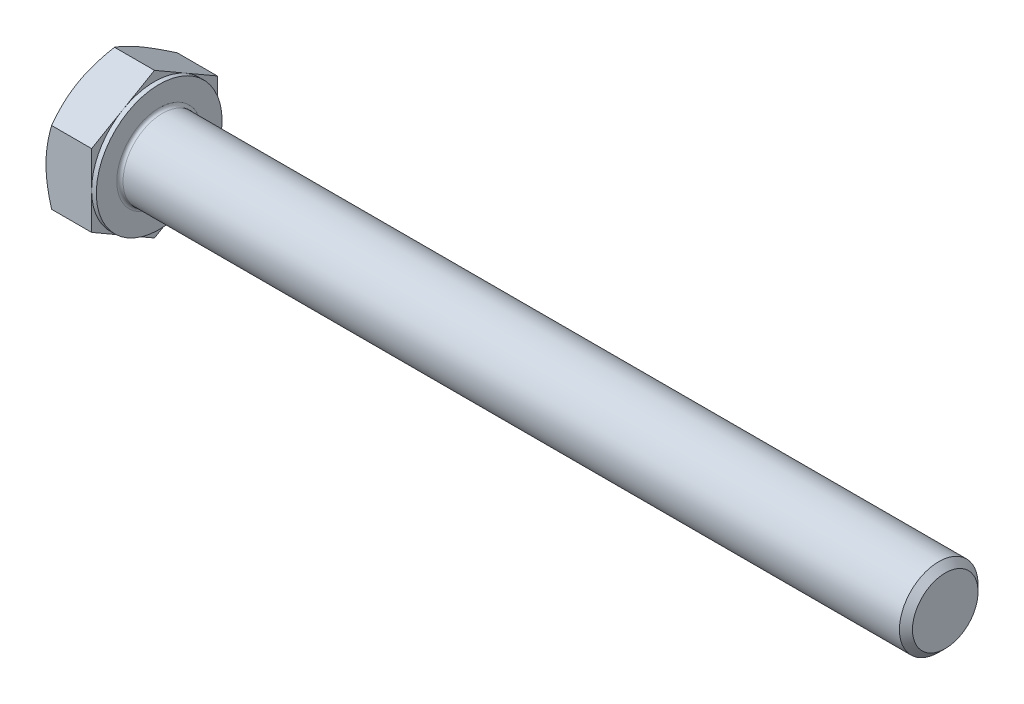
ISO-10303-21;
HEADER;
FILE_DESCRIPTION(('STEP AP214'),'2;1');
FILE_NAME('part.step','',(''),(''),'','','');
FILE_SCHEMA(('AUTOMOTIVE_DESIGN { 1 0 10303 214 1 1 1 1 }'));
ENDSEC;
DATA;
#1=APPLICATION_CONTEXT('core data for automotive mechanical design processes');
#2=APPLICATION_PROTOCOL_DEFINITION('international standard','automotive_design',2000,#1);
#3=PRODUCT_CONTEXT('',#1,'mechanical');
#4=PRODUCT('Part','Part','',(#3));
#5=PRODUCT_RELATED_PRODUCT_CATEGORY('part','',(#4));
#6=PRODUCT_DEFINITION_FORMATION('','',#4);
#7=PRODUCT_DEFINITION_CONTEXT('part definition',#1,'design');
#8=PRODUCT_DEFINITION('design','',#6,#7);
#9=PRODUCT_DEFINITION_SHAPE('','',#8);
#10=(LENGTH_UNIT() NAMED_UNIT(*) SI_UNIT(.MILLI.,.METRE.));
#11=(NAMED_UNIT(*) PLANE_ANGLE_UNIT() SI_UNIT($,.RADIAN.));
#12=(NAMED_UNIT(*) SI_UNIT($,.STERADIAN.) SOLID_ANGLE_UNIT());
#13=UNCERTAINTY_MEASURE_WITH_UNIT(LENGTH_MEASURE(1.E-05),#10,'distance_accuracy_value','');
#14=(GEOMETRIC_REPRESENTATION_CONTEXT(3) GLOBAL_UNCERTAINTY_ASSIGNED_CONTEXT((#13)) GLOBAL_UNIT_ASSIGNED_CONTEXT((#10,
#11,#12)) REPRESENTATION_CONTEXT('',''));
#15=CARTESIAN_POINT('',(0.,0.,0.));
#16=DIRECTION('',(0.,0.,1.));
#17=DIRECTION('',(1.,0.,0.));
#18=AXIS2_PLACEMENT_3D('',#15,#16,#17);
#19=CARTESIAN_POINT('',(6.4,9.23760430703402,0.));
#20=DIRECTION('',(1.,0.,0.));
#21=DIRECTION('',(0.,0.,-1.));
#22=AXIS2_PLACEMENT_3D('',#19,#20,#21);
#23=PLANE('',#22);
#24=CARTESIAN_POINT('',(6.4,0.,0.));
#25=DIRECTION('',(1.,0.,0.));
#26=DIRECTION('',(0.,0.,-1.));
#27=AXIS2_PLACEMENT_3D('',#24,#25,#26);
#28=CIRCLE('',#27,5.4);
#29=CARTESIAN_POINT('',(6.4,0.,-5.4));
#30=VERTEX_POINT('',#29);
#31=EDGE_CURVE('E39',#30,#30,#28,.F.);
#32=ORIENTED_EDGE('',*,*,#31,.T.);
#33=EDGE_LOOP('',(#32));
#34=FACE_BOUND('',#33,.T.);
#35=CARTESIAN_POINT('',(6.4,0.,0.));
#36=DIRECTION('',(1.,0.,0.));
#37=DIRECTION('',(0.,0.,-1.));
#38=AXIS2_PLACEMENT_3D('',#35,#36,#37);
#39=CIRCLE('',#38,8.);
#40=CARTESIAN_POINT('',(6.4,0.,-8.));
#41=VERTEX_POINT('',#40);
#42=EDGE_CURVE('E290',#41,#41,#39,.T.);
#43=ORIENTED_EDGE('',*,*,#42,.T.);
#44=EDGE_LOOP('',(#43));
#45=FACE_BOUND('',#44,.T.);
#46=ADVANCED_FACE('F31',(#34,#45),#23,.T.);
#47=CARTESIAN_POINT('',(0.,0.,0.));
#48=DIRECTION('',(-1.,0.,0.));
#49=DIRECTION('',(0.,0.,1.));
#50=AXIS2_PLACEMENT_3D('',#47,#48,#49);
#51=CYLINDRICAL_SURFACE('',#50,5.);
#52=CARTESIAN_POINT('',(6.8,0.,0.));
#53=DIRECTION('',(1.,0.,0.));
#54=DIRECTION('',(0.,0.,-1.));
#55=AXIS2_PLACEMENT_3D('',#52,#53,#54);
#56=CIRCLE('',#55,5.);
#57=CARTESIAN_POINT('',(6.8,0.,-5.));
#58=VERTEX_POINT('',#57);
#59=EDGE_CURVE('E11',#58,#58,#56,.T.);
#60=ORIENTED_EDGE('',*,*,#59,.T.);
#61=EDGE_LOOP('',(#60));
#62=FACE_BOUND('',#61,.T.);
#63=CARTESIAN_POINT('',(105.572,0.,0.));
#64=DIRECTION('',(-1.,0.,0.));
#65=DIRECTION('',(0.,0.,1.));
#66=AXIS2_PLACEMENT_3D('',#63,#64,#65);
#67=CIRCLE('',#66,5.);
#68=CARTESIAN_POINT('',(105.572,0.,5.));
#69=VERTEX_POINT('',#68);
#70=EDGE_CURVE('E269',#69,#69,#67,.T.);
#71=ORIENTED_EDGE('',*,*,#70,.T.);
#72=EDGE_LOOP('',(#71));
#73=FACE_BOUND('',#72,.T.);
#74=ADVANCED_FACE('F243',(#62,#73),#51,.T.);
#75=CARTESIAN_POINT('',(106.4,0.,0.));
#76=DIRECTION('',(-1.,0.,0.));
#77=DIRECTION('',(0.,0.,1.));
#78=AXIS2_PLACEMENT_3D('',#75,#76,#77);
#79=CONICAL_SURFACE('',#78,4.172,0.785398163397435);
#80=ORIENTED_EDGE('',*,*,#70,.F.);
#81=EDGE_LOOP('',(#80));
#82=FACE_BOUND('',#81,.T.);
#83=CARTESIAN_POINT('',(106.4,0.,0.));
#84=DIRECTION('',(-1.,0.,0.));
#85=DIRECTION('',(0.,0.,1.));
#86=AXIS2_PLACEMENT_3D('',#83,#84,#85);
#87=CIRCLE('',#86,4.172);
#88=CARTESIAN_POINT('',(106.4,0.,4.172));
#89=VERTEX_POINT('',#88);
#90=EDGE_CURVE('E267',#89,#89,#87,.T.);
#91=ORIENTED_EDGE('',*,*,#90,.T.);
#92=EDGE_LOOP('',(#91));
#93=FACE_BOUND('',#92,.T.);
#94=ADVANCED_FACE('F248',(#82,#93),#79,.T.);
#95=CARTESIAN_POINT('',(106.4,0.,0.));
#96=DIRECTION('',(-1.,0.,0.));
#97=DIRECTION('',(0.,0.,1.));
#98=AXIS2_PLACEMENT_3D('',#95,#96,#97);
#99=PLANE('',#98);
#100=ORIENTED_EDGE('',*,*,#90,.F.);
#101=EDGE_LOOP('',(#100));
#102=FACE_BOUND('',#101,.T.);
#103=ADVANCED_FACE('F255',(#102),#99,.F.);
#104=CARTESIAN_POINT('',(5.8,8.,0.));
#105=DIRECTION('',(1.,0.,0.));
#106=DIRECTION('',(0.,0.,-1.));
#107=AXIS2_PLACEMENT_3D('',#104,#105,#106);
#108=PLANE('',#107);
#109=DIRECTION('',(0.,0.500000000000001,0.866025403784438));
#110=VECTOR('',#109,1.);
#111=CARTESIAN_POINT('',(5.8,4.618802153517,-8.));
#112=LINE('',#111,#110);
#113=CARTESIAN_POINT('',(5.8,4.618802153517,-8.));
#114=VERTEX_POINT('',#113);
#115=CARTESIAN_POINT('',(5.8,6.9282032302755,-4.00000000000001));
#116=VERTEX_POINT('',#115);
#117=EDGE_CURVE('E163',#114,#116,#112,.T.);
#118=ORIENTED_EDGE('',*,*,#117,.T.);
#119=CARTESIAN_POINT('',(5.8,0.,0.));
#120=DIRECTION('',(-1.,0.,0.));
#121=DIRECTION('',(0.,0.,1.));
#122=AXIS2_PLACEMENT_3D('',#119,#120,#121);
#123=CIRCLE('',#122,8.);
#124=CARTESIAN_POINT('',(5.8,0.,-8.));
#125=VERTEX_POINT('',#124);
#126=EDGE_CURVE('E46',#116,#125,#123,.T.);
#127=ORIENTED_EDGE('',*,*,#126,.T.);
#128=DIRECTION('',(0.,1.,0.));
#129=VECTOR('',#128,1.);
#130=CARTESIAN_POINT('',(5.8,4.618802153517,-8.));
#131=LINE('',#130,#129);
#132=EDGE_CURVE('E293',#125,#114,#131,.T.);
#133=ORIENTED_EDGE('',*,*,#132,.T.);
#134=EDGE_LOOP('',(#118,#127,#133));
#135=FACE_BOUND('',#134,.T.);
#136=ADVANCED_FACE('F258',(#135),#108,.T.);
#137=CARTESIAN_POINT('',(5.8,9.23760430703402,0.));
#138=VERTEX_POINT('',#137);
#139=EDGE_CURVE('E161',#116,#138,#112,.T.);
#140=ORIENTED_EDGE('',*,*,#139,.T.);
#141=DIRECTION('',(0.,-0.500000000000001,0.866025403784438));
#142=VECTOR('',#141,1.);
#143=CARTESIAN_POINT('',(5.8,9.23760430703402,0.));
#144=LINE('',#143,#142);
#145=CARTESIAN_POINT('',(5.8,6.9282032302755,4.00000000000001));
#146=VERTEX_POINT('',#145);
#147=EDGE_CURVE('E160',#138,#146,#144,.T.);
#148=ORIENTED_EDGE('',*,*,#147,.T.);
#149=EDGE_CURVE('E149',#146,#116,#123,.T.);
#150=ORIENTED_EDGE('',*,*,#149,.T.);
#151=EDGE_LOOP('',(#140,#148,#150));
#152=FACE_BOUND('',#151,.T.);
#153=ADVANCED_FACE('F263',(#152),#108,.T.);
#154=CARTESIAN_POINT('',(5.8,4.618802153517,8.));
#155=VERTEX_POINT('',#154);
#156=EDGE_CURVE('E128',#146,#155,#144,.T.);
#157=ORIENTED_EDGE('',*,*,#156,.T.);
#158=DIRECTION('',(0.,-1.,0.));
#159=VECTOR('',#158,1.);
#160=CARTESIAN_POINT('',(5.8,4.618802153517,8.));
#161=LINE('',#160,#159);
#162=CARTESIAN_POINT('',(5.8,0.,8.));
#163=VERTEX_POINT('',#162);
#164=EDGE_CURVE('E122',#155,#163,#161,.T.);
#165=ORIENTED_EDGE('',*,*,#164,.T.);
#166=EDGE_CURVE('E126',#163,#146,#123,.T.);
#167=ORIENTED_EDGE('',*,*,#166,.T.);
#168=EDGE_LOOP('',(#157,#165,#167));
#169=FACE_BOUND('',#168,.T.);
#170=ADVANCED_FACE('F124',(#169),#108,.T.);
#171=CARTESIAN_POINT('',(5.8,-4.61880215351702,8.));
#172=VERTEX_POINT('',#171);
#173=EDGE_CURVE('E132',#163,#172,#161,.T.);
#174=ORIENTED_EDGE('',*,*,#173,.T.);
#175=DIRECTION('',(0.,-0.500000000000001,-0.866025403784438));
#176=VECTOR('',#175,1.);
#177=CARTESIAN_POINT('',(5.8,-9.23760430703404,0.));
#178=LINE('',#177,#176);
#179=CARTESIAN_POINT('',(5.8,-6.92820323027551,4.00000000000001));
#180=VERTEX_POINT('',#179);
#181=EDGE_CURVE('E139',#172,#180,#178,.T.);
#182=ORIENTED_EDGE('',*,*,#181,.T.);
#183=EDGE_CURVE('E136',#180,#163,#123,.T.);
#184=ORIENTED_EDGE('',*,*,#183,.T.);
#185=EDGE_LOOP('',(#174,#182,#184));
#186=FACE_BOUND('',#185,.T.);
#187=ADVANCED_FACE('F137',(#186),#108,.T.);
#188=CARTESIAN_POINT('',(5.8,-9.23760430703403,0.));
#189=VERTEX_POINT('',#188);
#190=EDGE_CURVE('E155',#180,#189,#178,.T.);
#191=ORIENTED_EDGE('',*,*,#190,.T.);
#192=DIRECTION('',(0.,0.500000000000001,-0.866025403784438));
#193=VECTOR('',#192,1.);
#194=CARTESIAN_POINT('',(5.8,-4.61880215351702,-8.));
#195=LINE('',#194,#193);
#196=CARTESIAN_POINT('',(5.8,-6.92820323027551,-4.00000000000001));
#197=VERTEX_POINT('',#196);
#198=EDGE_CURVE('E331',#189,#197,#195,.T.);
#199=ORIENTED_EDGE('',*,*,#198,.T.);
#200=EDGE_CURVE('E143',#197,#180,#123,.T.);
#201=ORIENTED_EDGE('',*,*,#200,.T.);
#202=EDGE_LOOP('',(#191,#199,#201));
#203=FACE_BOUND('',#202,.T.);
#204=ADVANCED_FACE('F332',(#203),#108,.T.);
#205=CARTESIAN_POINT('',(5.8,-4.61880215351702,-8.));
#206=VERTEX_POINT('',#205);
#207=EDGE_CURVE('E150',#197,#206,#195,.T.);
#208=ORIENTED_EDGE('',*,*,#207,.T.);
#209=EDGE_CURVE('E294',#206,#125,#131,.T.);
#210=ORIENTED_EDGE('',*,*,#209,.T.);
#211=EDGE_CURVE('E301',#125,#197,#123,.T.);
#212=ORIENTED_EDGE('',*,*,#211,.T.);
#213=EDGE_LOOP('',(#208,#210,#212));
#214=FACE_BOUND('',#213,.T.);
#215=ADVANCED_FACE('F264',(#214),#108,.T.);
#216=CARTESIAN_POINT('',(0.,0.,0.));
#217=DIRECTION('',(-1.,0.,0.));
#218=DIRECTION('',(0.,0.,1.));
#219=AXIS2_PLACEMENT_3D('',#216,#217,#218);
#220=CYLINDRICAL_SURFACE('',#219,8.);
#221=ORIENTED_EDGE('',*,*,#126,.F.);
#222=ORIENTED_EDGE('',*,*,#149,.F.);
#223=ORIENTED_EDGE('',*,*,#166,.F.);
#224=ORIENTED_EDGE('',*,*,#183,.F.);
#225=ORIENTED_EDGE('',*,*,#200,.F.);
#226=ORIENTED_EDGE('',*,*,#211,.F.);
#227=EDGE_LOOP('',(#221,#222,#223,#224,#225,#226));
#228=FACE_BOUND('',#227,.T.);
#229=ORIENTED_EDGE('',*,*,#42,.F.);
#230=EDGE_LOOP('',(#229));
#231=FACE_BOUND('',#230,.T.);
#232=ADVANCED_FACE('F146',(#228,#231),#220,.T.);
#233=CARTESIAN_POINT('',(0.,9.23760430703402,0.));
#234=DIRECTION('',(1.,0.,0.));
#235=DIRECTION('',(0.,0.,-1.));
#236=AXIS2_PLACEMENT_3D('',#233,#234,#235);
#237=PLANE('',#236);
#238=CARTESIAN_POINT('',(0.,0.,0.));
#239=DIRECTION('',(1.,0.,0.));
#240=DIRECTION('',(0.,0.,-1.));
#241=AXIS2_PLACEMENT_3D('',#238,#239,#240);
#242=CIRCLE('',#241,8.);
#243=CARTESIAN_POINT('',(0.,0.,-8.));
#244=VERTEX_POINT('',#243);
#245=CARTESIAN_POINT('',(0.,6.92820323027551,-4.00000000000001));
#246=VERTEX_POINT('',#245);
#247=EDGE_CURVE('E289',#244,#246,#242,.T.);
#248=ORIENTED_EDGE('',*,*,#247,.F.);
#249=CARTESIAN_POINT('',(0.,-6.92820323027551,-4.00000000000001));
#250=VERTEX_POINT('',#249);
#251=EDGE_CURVE('E285',#250,#244,#242,.T.);
#252=ORIENTED_EDGE('',*,*,#251,.F.);
#253=CARTESIAN_POINT('',(0.,-6.92820323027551,4.00000000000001));
#254=VERTEX_POINT('',#253);
#255=EDGE_CURVE('E288',#254,#250,#242,.T.);
#256=ORIENTED_EDGE('',*,*,#255,.F.);
#257=CARTESIAN_POINT('',(0.,0.,8.));
#258=VERTEX_POINT('',#257);
#259=EDGE_CURVE('E324',#258,#254,#242,.T.);
#260=ORIENTED_EDGE('',*,*,#259,.F.);
#261=CARTESIAN_POINT('',(0.,0.,0.));
#262=DIRECTION('',(-1.,0.,0.));
#263=DIRECTION('',(0.,0.,1.));
#264=AXIS2_PLACEMENT_3D('',#261,#262,#263);
#265=CIRCLE('',#264,8.);
#266=CARTESIAN_POINT('',(0.,6.92820323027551,4.00000000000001));
#267=VERTEX_POINT('',#266);
#268=EDGE_CURVE('E164',#258,#267,#265,.T.);
#269=ORIENTED_EDGE('',*,*,#268,.T.);
#270=EDGE_CURVE('E347',#246,#267,#242,.T.);
#271=ORIENTED_EDGE('',*,*,#270,.F.);
#272=EDGE_LOOP('',(#248,#252,#256,#260,#269,#271));
#273=FACE_BOUND('',#272,.T.);
#274=ADVANCED_FACE('F193',(#273),#237,.F.);
#275=CARTESIAN_POINT('',(0.,0.,0.));
#276=DIRECTION('',(1.,0.,0.));
#277=DIRECTION('',(0.,0.,-1.));
#278=AXIS2_PLACEMENT_3D('',#275,#276,#277);
#279=CONICAL_SURFACE('',#278,8.,1.0471975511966);
#280=CARTESIAN_POINT('',(0.714597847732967,4.61868668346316,8.0002));
#281=CARTESIAN_POINT('',(0.655990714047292,4.72021302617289,7.8243512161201));
#282=CARTESIAN_POINT('',(0.600043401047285,4.82211789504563,7.64784680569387));
#283=CARTESIAN_POINT('',(0.494201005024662,5.02675523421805,7.29340453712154));
#284=CARTESIAN_POINT('',(0.444308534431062,5.12948804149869,7.11546609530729));
#285=CARTESIAN_POINT('',(0.304692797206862,5.43933133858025,6.57880176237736));
#286=CARTESIAN_POINT('',(0.225281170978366,5.64766491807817,6.21795741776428));
#287=CARTESIAN_POINT('',(0.132161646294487,5.95943209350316,5.67796082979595));
#288=CARTESIAN_POINT('',(0.105634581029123,6.06193429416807,5.50042181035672));
#289=CARTESIAN_POINT('',(0.0611531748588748,6.26740224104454,5.14454088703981));
#290=CARTESIAN_POINT('',(0.043198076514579,6.37036794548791,4.96619905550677));
#291=CARTESIAN_POINT('',(0.0163156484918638,6.57647664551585,4.60920831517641));
#292=CARTESIAN_POINT('',(0.00737807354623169,6.67961930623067,4.4305599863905));
#293=CARTESIAN_POINT('',(-0.00127769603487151,6.88599991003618,4.07309829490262));
#294=CARTESIAN_POINT('',(-0.000996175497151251,6.98923785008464,3.89428493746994));
#295=CARTESIAN_POINT('',(0.00814502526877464,7.18224506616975,3.5599866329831));
#296=CARTESIAN_POINT('',(0.0158896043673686,7.27202796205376,3.40447809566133));
#297=CARTESIAN_POINT('',(0.0382011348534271,7.45138347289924,3.09382523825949));
#298=CARTESIAN_POINT('',(0.0527685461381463,7.5409560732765,2.93868094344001));
#299=CARTESIAN_POINT('',(0.106360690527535,7.80932710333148,2.47384868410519));
#300=CARTESIAN_POINT('',(0.155268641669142,7.98765049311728,2.16498351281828));
#301=CARTESIAN_POINT('',(0.277539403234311,8.34618890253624,1.5439767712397));
#302=CARTESIAN_POINT('',(0.351420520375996,8.52635816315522,1.23191445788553));
#303=CARTESIAN_POINT('',(0.519100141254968,8.88400987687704,0.612443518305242));
#304=CARTESIAN_POINT('',(0.612859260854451,9.06149691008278,0.30502695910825));
#305=CARTESIAN_POINT('',(0.714597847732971,9.23771977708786,-0.000199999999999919));
#306=B_SPLINE_CURVE_WITH_KNOTS('',3,(#280,#281,#282,#283,#284,#285,#286,#287,#288,#289,#290,
#291,#292,#293,#294,#295,#296,#297,#298,#299,#300,#301,#302,#303,#304,#305),.UNSPECIFIED.,.F.,
.F.,(4,2,2,2,2,2,2,2,2,2,2,2,4),(0.,0.633973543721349,1.26821965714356,2.53934712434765,
3.15934343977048,3.77928496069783,4.39852133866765,5.01773858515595,5.55680239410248,
6.09590254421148,7.17487077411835,8.27776850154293,9.37850115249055),.UNSPECIFIED.);
#307=CARTESIAN_POINT('',(0.714531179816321,9.23760430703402,0.));
#308=VERTEX_POINT('',#307);
#309=EDGE_CURVE('E212',#267,#308,#306,.T.);
#310=ORIENTED_EDGE('',*,*,#309,.T.);
#311=CARTESIAN_POINT('',(0.714597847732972,9.23771977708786,0.000199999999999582));
#312=CARTESIAN_POINT('',(0.655990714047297,9.13619343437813,-0.175648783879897));
#313=CARTESIAN_POINT('',(0.60004340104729,9.03428856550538,-0.352153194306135));
#314=CARTESIAN_POINT('',(0.494201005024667,8.82965122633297,-0.706595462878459));
#315=CARTESIAN_POINT('',(0.444308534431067,8.72691841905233,-0.884533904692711));
#316=CARTESIAN_POINT('',(0.304692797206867,8.41707512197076,-1.42119823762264));
#317=CARTESIAN_POINT('',(0.225281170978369,8.20874154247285,-1.78204258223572));
#318=CARTESIAN_POINT('',(0.132161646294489,7.89697436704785,-2.32203917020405));
#319=CARTESIAN_POINT('',(0.105634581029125,7.79447216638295,-2.49957818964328));
#320=CARTESIAN_POINT('',(0.061153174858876,7.58900421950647,-2.8554591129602));
#321=CARTESIAN_POINT('',(0.0431980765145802,7.4860385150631,-3.03380094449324));
#322=CARTESIAN_POINT('',(0.0163156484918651,7.27992981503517,-3.39079168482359));
#323=CARTESIAN_POINT('',(0.00737807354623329,7.17678715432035,-3.5694400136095));
#324=CARTESIAN_POINT('',(-0.00127769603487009,6.97040655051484,-3.92690170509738));
#325=CARTESIAN_POINT('',(-0.000996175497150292,6.86716861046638,-4.10571506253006));
#326=CARTESIAN_POINT('',(0.00814502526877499,6.67416139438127,-4.4400133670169));
#327=CARTESIAN_POINT('',(0.0158896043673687,6.58437849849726,-4.59552190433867));
#328=CARTESIAN_POINT('',(0.0382011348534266,6.40502298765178,-4.90617476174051));
#329=CARTESIAN_POINT('',(0.0527685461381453,6.31545038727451,-5.06131905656));
#330=CARTESIAN_POINT('',(0.106360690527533,6.04707935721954,-5.52615131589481));
#331=CARTESIAN_POINT('',(0.15526864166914,5.86875596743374,-5.83501648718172));
#332=CARTESIAN_POINT('',(0.277539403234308,5.51021755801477,-6.4560232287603));
#333=CARTESIAN_POINT('',(0.351420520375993,5.3300482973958,-6.76808554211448));
#334=CARTESIAN_POINT('',(0.519100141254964,4.97239658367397,-7.38755648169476));
#335=CARTESIAN_POINT('',(0.612859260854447,4.79490955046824,-7.69497304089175));
#336=CARTESIAN_POINT('',(0.714597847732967,4.61868668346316,-8.0002));
#337=B_SPLINE_CURVE_WITH_KNOTS('',3,(#311,#312,#313,#314,#315,#316,#317,#318,#319,#320,#321,
#322,#323,#324,#325,#326,#327,#328,#329,#330,#331,#332,#333,#334,#335,#336),.UNSPECIFIED.,.F.,
.F.,(4,2,2,2,2,2,2,2,2,2,2,2,4),(0.,0.633973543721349,1.26821965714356,2.53934712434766,
3.15934343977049,3.77928496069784,4.39852133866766,5.01773858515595,5.55680239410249,
6.09590254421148,7.17487077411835,8.27776850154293,9.37850115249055),.UNSPECIFIED.);
#338=EDGE_CURVE('E54',#308,#246,#337,.T.);
#339=ORIENTED_EDGE('',*,*,#338,.T.);
#340=ORIENTED_EDGE('',*,*,#270,.T.);
#341=EDGE_LOOP('',(#310,#339,#340));
#342=FACE_BOUND('',#341,.T.);
#343=ADVANCED_FACE('F348',(#342),#279,.T.);
#344=CARTESIAN_POINT('',(4.02490590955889,-12.6546855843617,8.));
#345=CARTESIAN_POINT('',(3.85338487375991,-12.3031246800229,8.));
#346=CARTESIAN_POINT('',(3.683438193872,-11.9507829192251,8.));
#347=CARTESIAN_POINT('',(3.34757427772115,-11.2441233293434,8.));
#348=CARTESIAN_POINT('',(3.1816576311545,-10.889805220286,8.));
#349=CARTESIAN_POINT('',(2.85395194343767,-10.1770689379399,8.));
#350=CARTESIAN_POINT('',(2.69218824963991,-9.81863907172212,8.));
#351=CARTESIAN_POINT('',(2.37495726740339,-9.09901412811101,8.));
#352=CARTESIAN_POINT('',(2.21948969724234,-8.73781917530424,8.));
#353=CARTESIAN_POINT('',(1.91124909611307,-7.99950051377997,8.));
#354=CARTESIAN_POINT('',(1.75875676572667,-7.62225899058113,8.));
#355=CARTESIAN_POINT('',(1.4647241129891,-6.86345576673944,8.));
#356=CARTESIAN_POINT('',(1.32318498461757,-6.4818936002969,8.));
#357=CARTESIAN_POINT('',(1.05459432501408,-5.71447512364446,8.));
#358=CARTESIAN_POINT('',(0.927515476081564,-5.32862847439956,8.));
#359=CARTESIAN_POINT('',(0.691757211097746,-4.55141880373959,8.));
#360=CARTESIAN_POINT('',(0.583072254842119,-4.16005748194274,8.));
#361=CARTESIAN_POINT('',(0.389750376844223,-3.37376378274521,8.));
#362=CARTESIAN_POINT('',(0.304973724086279,-2.9788666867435,8.));
#363=CARTESIAN_POINT('',(0.199275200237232,-2.38273452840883,8.));
#364=CARTESIAN_POINT('',(0.167618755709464,-2.1833797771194,8.));
#365=CARTESIAN_POINT('',(0.112075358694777,-1.78359737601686,8.));
#366=CARTESIAN_POINT('',(0.0881876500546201,-1.58316983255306,8.));
#367=CARTESIAN_POINT('',(0.0489706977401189,-1.18423542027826,8.));
#368=CARTESIAN_POINT('',(0.0335291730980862,-0.985739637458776,8.));
#369=CARTESIAN_POINT('',(0.011062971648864,-0.588272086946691,8.));
#370=CARTESIAN_POINT('',(0.00403814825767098,-0.389300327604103,8.));
#371=CARTESIAN_POINT('',(-0.00142584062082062,0.0087622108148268,8.));
#372=CARTESIAN_POINT('',(0.000134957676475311,0.207852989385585,8.));
#373=CARTESIAN_POINT('',(0.011801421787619,0.605786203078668,8.));
#374=CARTESIAN_POINT('',(0.0219074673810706,0.804628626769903,8.));
#375=CARTESIAN_POINT('',(0.0557165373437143,1.27520491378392,8.));
#376=CARTESIAN_POINT('',(0.0830672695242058,1.54668291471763,8.));
#377=CARTESIAN_POINT('',(0.152259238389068,2.08777092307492,8.));
#378=CARTESIAN_POINT('',(0.194102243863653,2.35738069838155,8.));
#379=CARTESIAN_POINT('',(0.339163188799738,3.16301774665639,8.));
#380=CARTESIAN_POINT('',(0.461891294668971,3.69558688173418,8.));
#381=CARTESIAN_POINT('',(0.676586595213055,4.49226053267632,8.));
#382=CARTESIAN_POINT('',(0.754301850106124,4.76044512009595,8.));
#383=CARTESIAN_POINT('',(0.91827561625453,5.29421544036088,8.));
#384=CARTESIAN_POINT('',(1.00453419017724,5.55980115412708,8.));
#385=CARTESIAN_POINT('',(1.18417203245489,6.08844836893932,8.));
#386=CARTESIAN_POINT('',(1.27754931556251,6.35151055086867,8.));
#387=CARTESIAN_POINT('',(1.47027924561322,6.87542420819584,8.));
#388=CARTESIAN_POINT('',(1.56963178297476,7.13627572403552,8.));
#389=CARTESIAN_POINT('',(1.83061788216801,7.80218874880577,8.));
#390=CARTESIAN_POINT('',(1.99585030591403,8.20583800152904,8.));
#391=CARTESIAN_POINT('',(2.33560643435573,9.00922090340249,8.));
#392=CARTESIAN_POINT('',(2.5101309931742,9.40895418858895,8.));
#393=CARTESIAN_POINT('',(2.86641484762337,10.2053302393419,8.));
#394=CARTESIAN_POINT('',(3.04817649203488,10.6019719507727,8.));
#395=CARTESIAN_POINT('',(3.41731474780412,11.3926098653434,8.));
#396=CARTESIAN_POINT('',(3.60469117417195,11.7866061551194,8.));
#397=CARTESIAN_POINT('',(3.9841797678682,12.5730081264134,8.));
#398=CARTESIAN_POINT('',(4.17629837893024,12.9654106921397,8.));
#399=CARTESIAN_POINT('',(4.56413460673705,13.7484335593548,8.));
#400=CARTESIAN_POINT('',(4.75985224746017,14.1390538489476,8.));
#401=CARTESIAN_POINT('',(5.15417790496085,14.91873869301,8.));
#402=CARTESIAN_POINT('',(5.35278537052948,15.3078035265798,8.));
#403=CARTESIAN_POINT('',(5.75241277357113,16.0846929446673,8.));
#404=CARTESIAN_POINT('',(5.95343272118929,16.4725175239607,8.));
#405=CARTESIAN_POINT('',(6.52023157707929,17.5591699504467,8.));
#406=CARTESIAN_POINT('',(6.88826669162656,18.2568207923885,8.));
#407=CARTESIAN_POINT('',(7.62911645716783,19.6496204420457,8.));
#408=CARTESIAN_POINT('',(8.00193135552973,20.3447691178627,8.));
#409=CARTESIAN_POINT('',(8.74998840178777,21.730949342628,8.));
#410=CARTESIAN_POINT('',(9.12521929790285,22.4219869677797,8.));
#411=CARTESIAN_POINT('',(9.690126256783,23.4573861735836,8.));
#412=CARTESIAN_POINT('',(9.87876537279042,23.8023143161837,8.));
#413=CARTESIAN_POINT('',(10.2566598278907,24.4918321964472,8.));
#414=CARTESIAN_POINT('',(10.4459151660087,24.8364219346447,8.));
#415=CARTESIAN_POINT('',(10.635441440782,25.1808626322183,8.));
#416=B_SPLINE_CURVE_WITH_KNOTS('',3,(#344,#345,#346,#347,#348,#349,#350,#351,#352,#353,#354,
#355,#356,#357,#358,#359,#360,#361,#362,#363,#364,#365,#366,#367,#368,#369,#370,#371,#372,#373,
#374,#375,#376,#377,#378,#379,#380,#381,#382,#383,#384,#385,#386,#387,#388,#389,#390,#391,#392,
#393,#394,#395,#396,#397,#398,#399,#400,#401,#402,#403,#404,#405,#406,#407,#408,#409,#410,#411,
#412,#413,#414,#415),.UNSPECIFIED.,.F.,.F.,(4,2,2,2,2,2,2,2,2,2,2,2,2,2,2,2,2,2,2,2,2,2,2,2,2,2,
2,2,2,2,2,2,2,2,2,4),(0.,1.17352534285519,2.34722138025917,3.52689945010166,4.70652467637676,
5.92708317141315,7.14777452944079,8.36612012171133,9.58409809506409,10.7948027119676,
11.4002329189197,12.0056041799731,12.6027191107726,13.199823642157,13.7969256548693,
14.3940542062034,15.2121538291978,16.0303533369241,17.6675489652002,18.5051258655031,
19.3427089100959,20.1800592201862,21.0173941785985,22.3257038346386,23.6341339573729,
24.9429922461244,26.2518074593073,27.5625113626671,28.8732240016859,30.1836898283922,
31.4941611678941,33.8604585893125,36.2268789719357,38.5858914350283,39.7653150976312,
40.9447368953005),.UNSPECIFIED.);
#417=CARTESIAN_POINT('',(0.714531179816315,4.618802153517,8.));
#418=VERTEX_POINT('',#417);
#419=EDGE_CURVE('E224',#258,#418,#416,.T.);
#420=ORIENTED_EDGE('',*,*,#419,.T.);
#421=EDGE_CURVE('E223',#418,#267,#306,.T.);
#422=ORIENTED_EDGE('',*,*,#421,.T.);
#423=ORIENTED_EDGE('',*,*,#268,.F.);
#424=EDGE_LOOP('',(#420,#422,#423));
#425=FACE_BOUND('',#424,.T.);
#426=ADVANCED_FACE('F318',(#425),#279,.T.);
#427=CARTESIAN_POINT('',(0.714531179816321,-4.61880215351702,8.));
#428=VERTEX_POINT('',#427);
#429=EDGE_CURVE('E270',#428,#258,#416,.T.);
#430=ORIENTED_EDGE('',*,*,#429,.T.);
#431=ORIENTED_EDGE('',*,*,#259,.T.);
#432=CARTESIAN_POINT('',(0.714597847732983,-9.23771977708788,-0.000199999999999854));
#433=CARTESIAN_POINT('',(0.655990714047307,-9.13619343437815,0.175648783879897));
#434=CARTESIAN_POINT('',(0.6000434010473,-9.0342885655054,0.352153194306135));
#435=CARTESIAN_POINT('',(0.494201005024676,-8.82965122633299,0.706595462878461));
#436=CARTESIAN_POINT('',(0.444308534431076,-8.72691841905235,0.884533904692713));
#437=CARTESIAN_POINT('',(0.304692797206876,-8.41707512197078,1.42119823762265));
#438=CARTESIAN_POINT('',(0.225281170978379,-8.20874154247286,1.78204258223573));
#439=CARTESIAN_POINT('',(0.132161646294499,-7.89697436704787,2.32203917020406));
#440=CARTESIAN_POINT('',(0.105634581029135,-7.79447216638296,2.49957818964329));
#441=CARTESIAN_POINT('',(0.0611531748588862,-7.58900421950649,2.8554591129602));
#442=CARTESIAN_POINT('',(0.0431980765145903,-7.48603851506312,3.03380094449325));
#443=CARTESIAN_POINT('',(0.0163156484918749,-7.27992981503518,3.3907916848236));
#444=CARTESIAN_POINT('',(0.00737807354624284,-7.17678715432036,3.56944001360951));
#445=CARTESIAN_POINT('',(-0.00127769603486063,-6.97040655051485,3.92690170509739));
#446=CARTESIAN_POINT('',(-0.000996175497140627,-6.86716861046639,4.10571506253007));
#447=CARTESIAN_POINT('',(0.00814502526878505,-6.67416139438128,4.44001336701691));
#448=CARTESIAN_POINT('',(0.0158896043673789,-6.58437849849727,4.59552190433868));
#449=CARTESIAN_POINT('',(0.0382011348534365,-6.40502298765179,4.90617476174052));
#450=CARTESIAN_POINT('',(0.0527685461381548,-6.31545038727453,5.06131905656));
#451=CARTESIAN_POINT('',(0.106360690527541,-6.04707935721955,5.52615131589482));
#452=CARTESIAN_POINT('',(0.155268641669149,-5.86875596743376,5.83501648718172));
#453=CARTESIAN_POINT('',(0.277539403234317,-5.51021755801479,6.4560232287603));
#454=CARTESIAN_POINT('',(0.351420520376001,-5.33004829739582,6.76808554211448));
#455=CARTESIAN_POINT('',(0.51910014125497,-4.97239658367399,7.38755648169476));
#456=CARTESIAN_POINT('',(0.612859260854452,-4.79490955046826,7.69497304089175));
#457=CARTESIAN_POINT('',(0.714597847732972,-4.61868668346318,8.0002));
#458=B_SPLINE_CURVE_WITH_KNOTS('',3,(#432,#433,#434,#435,#436,#437,#438,#439,#440,#441,#442,
#443,#444,#445,#446,#447,#448,#449,#450,#451,#452,#453,#454,#455,#456,#457),.UNSPECIFIED.,.F.,
.F.,(4,2,2,2,2,2,2,2,2,2,2,2,4),(0.,0.633973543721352,1.26821965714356,2.53934712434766,
3.1593434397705,3.77928496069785,4.39852133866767,5.01773858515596,5.55680239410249,
6.09590254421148,7.17487077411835,8.27776850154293,9.37850115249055),.UNSPECIFIED.);
#459=EDGE_CURVE('E214',#254,#428,#458,.T.);
#460=ORIENTED_EDGE('',*,*,#459,.T.);
#461=EDGE_LOOP('',(#430,#431,#460));
#462=FACE_BOUND('',#461,.T.);
#463=ADVANCED_FACE('F182',(#462),#279,.T.);
#464=CARTESIAN_POINT('',(0.714531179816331,-9.23760430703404,0.));
#465=VERTEX_POINT('',#464);
#466=EDGE_CURVE('E207',#465,#254,#458,.T.);
#467=ORIENTED_EDGE('',*,*,#466,.T.);
#468=ORIENTED_EDGE('',*,*,#255,.T.);
#469=CARTESIAN_POINT('',(0.714597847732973,-4.61868668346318,-8.0002));
#470=CARTESIAN_POINT('',(0.655990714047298,-4.72021302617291,-7.82435121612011));
#471=CARTESIAN_POINT('',(0.600043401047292,-4.82211789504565,-7.64784680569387));
#472=CARTESIAN_POINT('',(0.494201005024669,-5.02675523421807,-7.29340453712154));
#473=CARTESIAN_POINT('',(0.44430853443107,-5.12948804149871,-7.11546609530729));
#474=CARTESIAN_POINT('',(0.304692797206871,-5.43933133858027,-6.57880176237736));
#475=CARTESIAN_POINT('',(0.225281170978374,-5.64766491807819,-6.21795741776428));
#476=CARTESIAN_POINT('',(0.132161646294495,-5.95943209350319,-5.67796082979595));
#477=CARTESIAN_POINT('',(0.105634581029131,-6.06193429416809,-5.50042181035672));
#478=CARTESIAN_POINT('',(0.0611531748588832,-6.26740224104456,-5.1445408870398));
#479=CARTESIAN_POINT('',(0.0431980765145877,-6.37036794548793,-4.96619905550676));
#480=CARTESIAN_POINT('',(0.0163156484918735,-6.57647664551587,-4.60920831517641));
#481=CARTESIAN_POINT('',(0.00737807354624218,-6.67961930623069,-4.4305599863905));
#482=CARTESIAN_POINT('',(-0.00127769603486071,-6.8859999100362,-4.07309829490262));
#483=CARTESIAN_POINT('',(-0.000996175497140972,-6.98923785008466,-3.89428493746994));
#484=CARTESIAN_POINT('',(0.00814502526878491,-7.18224506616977,-3.5599866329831));
#485=CARTESIAN_POINT('',(0.0158896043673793,-7.27202796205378,-3.40447809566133));
#486=CARTESIAN_POINT('',(0.0382011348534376,-7.45138347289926,-3.09382523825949));
#487=CARTESIAN_POINT('',(0.0527685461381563,-7.54095607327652,-2.93868094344));
#488=CARTESIAN_POINT('',(0.106360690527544,-7.8093271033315,-2.47384868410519));
#489=CARTESIAN_POINT('',(0.155268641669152,-7.9876504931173,-2.16498351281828));
#490=CARTESIAN_POINT('',(0.277539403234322,-8.34618890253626,-1.5439767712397));
#491=CARTESIAN_POINT('',(0.351420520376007,-8.52635816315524,-1.23191445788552));
#492=CARTESIAN_POINT('',(0.519100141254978,-8.88400987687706,-0.612443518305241));
#493=CARTESIAN_POINT('',(0.612859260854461,-9.06149691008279,-0.305026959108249));
#494=CARTESIAN_POINT('',(0.714597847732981,-9.23771977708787,0.000200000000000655));
#495=B_SPLINE_CURVE_WITH_KNOTS('',3,(#469,#470,#471,#472,#473,#474,#475,#476,#477,#478,#479,
#480,#481,#482,#483,#484,#485,#486,#487,#488,#489,#490,#491,#492,#493,#494),.UNSPECIFIED.,.F.,
.F.,(4,2,2,2,2,2,2,2,2,2,2,2,4),(0.,0.633973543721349,1.26821965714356,2.53934712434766,
3.15934343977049,3.77928496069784,4.39852133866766,5.01773858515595,5.55680239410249,
6.09590254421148,7.17487077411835,8.27776850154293,9.37850115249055),.UNSPECIFIED.);
#496=EDGE_CURVE('E213',#250,#465,#495,.T.);
#497=ORIENTED_EDGE('',*,*,#496,.T.);
#498=EDGE_LOOP('',(#467,#468,#497));
#499=FACE_BOUND('',#498,.T.);
#500=ADVANCED_FACE('F346',(#499),#279,.T.);
#501=CARTESIAN_POINT('',(0.714531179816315,4.618802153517,-8.));
#502=VERTEX_POINT('',#501);
#503=EDGE_CURVE('E215',#246,#502,#337,.T.);
#504=ORIENTED_EDGE('',*,*,#503,.T.);
#505=CARTESIAN_POINT('',(4.02490591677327,-12.6546855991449,-8.));
#506=CARTESIAN_POINT('',(3.8533848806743,-12.3031246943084,-8.));
#507=CARTESIAN_POINT('',(3.68343820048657,-11.9507829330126,-8.));
#508=CARTESIAN_POINT('',(3.34757428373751,-11.2441233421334,-8.));
#509=CARTESIAN_POINT('',(3.18165763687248,-10.8898052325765,-8.));
#510=CARTESIAN_POINT('',(2.85395194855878,-10.177068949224,-8.));
#511=CARTESIAN_POINT('',(2.69218825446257,-9.81863908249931,-8.));
#512=CARTESIAN_POINT('',(2.37495727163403,-9.09901413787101,-8.));
#513=CARTESIAN_POINT('',(2.21948970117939,-8.73781918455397,-8.));
#514=CARTESIAN_POINT('',(1.91124909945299,-7.99950052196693,-8.));
#515=CARTESIAN_POINT('',(1.75875676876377,-7.62225899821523,-8.));
#516=CARTESIAN_POINT('',(1.46472411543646,-6.86345577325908,-8.));
#517=CARTESIAN_POINT('',(1.32318498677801,-6.48189360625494,-8.));
#518=CARTESIAN_POINT('',(1.0545943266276,-5.71447512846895,-8.));
#519=CARTESIAN_POINT('',(0.92751547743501,-5.32862847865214,-8.));
#520=CARTESIAN_POINT('',(0.691757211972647,-4.55141880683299,-8.));
#521=CARTESIAN_POINT('',(0.583072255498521,-4.1600574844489,-8.));
#522=CARTESIAN_POINT('',(0.389750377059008,-3.37376378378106,-8.));
#523=CARTESIAN_POINT('',(0.30497372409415,-2.97886668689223,-8.));
#524=CARTESIAN_POINT('',(0.19927520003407,-2.38273452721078,-8.));
#525=CARTESIAN_POINT('',(0.167618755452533,-2.1833797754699,-8.));
#526=CARTESIAN_POINT('',(0.112075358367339,-1.78359737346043,-8.));
#527=CARTESIAN_POINT('',(0.0881876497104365,-1.58316982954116,-8.));
#528=CARTESIAN_POINT('',(0.0489706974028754,-1.18423541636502,-8.));
#529=CARTESIAN_POINT('',(0.0335291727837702,-0.985739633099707,-8.));
#530=CARTESIAN_POINT('',(0.0110629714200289,-0.588272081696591,-8.));
#531=CARTESIAN_POINT('',(0.00403814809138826,-0.3893003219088,-8.));
#532=CARTESIAN_POINT('',(-0.00142584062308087,0.00876221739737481,-8.));
#533=CARTESIAN_POINT('',(0.000134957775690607,0.207852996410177,-8.));
#534=CARTESIAN_POINT('',(0.011801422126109,0.605786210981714,-8.));
#535=CARTESIAN_POINT('',(0.0219074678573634,0.80462863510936,-8.));
#536=CARTESIAN_POINT('',(0.0557165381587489,1.27520492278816,-8.));
#537=CARTESIAN_POINT('',(0.0830672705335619,1.54668292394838,-8.));
#538=CARTESIAN_POINT('',(0.152259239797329,2.08777093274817,-8.));
#539=CARTESIAN_POINT('',(0.194102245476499,2.35738070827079,-8.));
#540=CARTESIAN_POINT('',(0.339163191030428,3.16301775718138,-8.));
#541=CARTESIAN_POINT('',(0.461891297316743,3.69558689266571,-8.));
#542=CARTESIAN_POINT('',(0.676586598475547,4.4922605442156,-8.));
#543=CARTESIAN_POINT('',(0.75430185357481,4.7604451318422,-8.));
#544=CARTESIAN_POINT('',(0.918275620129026,5.29421545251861,-8.));
#545=CARTESIAN_POINT('',(1.00453419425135,5.55980116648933,-8.));
#546=CARTESIAN_POINT('',(1.1841720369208,6.08844838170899,-8.));
#547=CARTESIAN_POINT('',(1.27754932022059,6.35151056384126,-8.));
#548=CARTESIAN_POINT('',(1.47027925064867,6.87542422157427,-8.));
#549=CARTESIAN_POINT('',(1.56963178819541,7.13627573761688,-8.));
#550=CARTESIAN_POINT('',(1.83061788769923,7.80218876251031,-8.));
#551=CARTESIAN_POINT('',(1.99585031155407,8.2058380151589,-8.));
#552=CARTESIAN_POINT('',(2.33560644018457,9.00922091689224,-8.));
#553=CARTESIAN_POINT('',(2.51013099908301,9.40895420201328,-8.));
#554=CARTESIAN_POINT('',(2.86641485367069,10.2053302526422,-8.));
#555=CARTESIAN_POINT('',(3.04817649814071,10.6019719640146,-8.));
#556=CARTESIAN_POINT('',(3.41731475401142,11.3926098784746,-8.));
#557=CARTESIAN_POINT('',(3.60469118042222,11.7866061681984,-8.));
#558=CARTESIAN_POINT('',(3.98417977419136,12.5730081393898,-8.));
#559=CARTESIAN_POINT('',(4.17629838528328,12.9654107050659,-8.));
#560=CARTESIAN_POINT('',(4.56413461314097,13.7484335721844,-8.));
#561=CARTESIAN_POINT('',(4.75985225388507,14.1390538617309,-8.));
#562=CARTESIAN_POINT('',(5.15417791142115,14.9187387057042,-8.));
#563=CARTESIAN_POINT('',(5.3527853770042,15.3078035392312,-8.));
#564=CARTESIAN_POINT('',(5.75241278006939,16.0846929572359,-8.));
#565=CARTESIAN_POINT('',(5.95343272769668,16.4725175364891,-8.));
#566=CARTESIAN_POINT('',(6.52023158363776,17.559169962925,-8.));
#567=CARTESIAN_POINT('',(6.88826669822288,18.2568208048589,-8.));
#568=CARTESIAN_POINT('',(7.62911646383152,19.6496204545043,-8.));
#569=CARTESIAN_POINT('',(8.00193136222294,20.3447691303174,-8.));
#570=CARTESIAN_POINT('',(8.74998840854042,21.7309493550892,-8.));
#571=CARTESIAN_POINT('',(9.12521930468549,22.4219869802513,-8.));
#572=CARTESIAN_POINT('',(9.69012626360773,23.4573861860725,-8.));
#573=CARTESIAN_POINT('',(9.87876537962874,23.8023143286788,-8.));
#574=CARTESIAN_POINT('',(10.2566598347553,24.491832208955,-8.));
#575=CARTESIAN_POINT('',(10.4459151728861,24.8364219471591,-8.));
#576=CARTESIAN_POINT('',(10.6354414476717,25.1808626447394,-8.));
#577=B_SPLINE_CURVE_WITH_KNOTS('',3,(#505,#506,#507,#508,#509,#510,#511,#512,#513,#514,#515,
#516,#517,#518,#519,#520,#521,#522,#523,#524,#525,#526,#527,#528,#529,#530,#531,#532,#533,#534,
#535,#536,#537,#538,#539,#540,#541,#542,#543,#544,#545,#546,#547,#548,#549,#550,#551,#552,#553,
#554,#555,#556,#557,#558,#559,#560,#561,#562,#563,#564,#565,#566,#567,#568,#569,#570,#571,#572,
#573,#574,#575,#576),.UNSPECIFIED.,.F.,.F.,(4,2,2,2,2,2,2,2,2,2,2,2,2,2,2,2,2,2,2,2,2,2,2,2,2,2,
2,2,2,2,2,2,2,2,2,4),(0.,1.17352534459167,2.34722138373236,3.52689945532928,4.70652468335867,
5.92708318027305,7.14777454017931,8.36612013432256,9.58409810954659,10.7948027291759,
11.40023293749,12.0056041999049,12.6027191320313,13.1998236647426,13.7969256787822,
14.3940542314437,15.2121538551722,16.0303533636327,17.6675489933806,18.5051258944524,
19.3427089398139,20.180059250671,21.0173942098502,22.3257038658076,23.6341339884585,
24.9429922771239,26.2518074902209,27.5625113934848,28.8732240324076,30.1836898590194,
31.494161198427,33.8604586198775,36.2268790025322,38.5858914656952,39.7653151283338,
40.9447369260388),.UNSPECIFIED.);
#578=EDGE_CURVE('E175',#502,#244,#577,.F.);
#579=ORIENTED_EDGE('',*,*,#578,.T.);
#580=ORIENTED_EDGE('',*,*,#247,.T.);
#581=EDGE_LOOP('',(#504,#579,#580));
#582=FACE_BOUND('',#581,.T.);
#583=ADVANCED_FACE('F343',(#582),#279,.T.);
#584=CARTESIAN_POINT('',(0.714531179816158,-4.61880215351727,-8.));
#585=VERTEX_POINT('',#584);
#586=EDGE_CURVE('E176',#585,#250,#495,.T.);
#587=ORIENTED_EDGE('',*,*,#586,.T.);
#588=ORIENTED_EDGE('',*,*,#251,.T.);
#589=EDGE_CURVE('E167',#244,#585,#577,.F.);
#590=ORIENTED_EDGE('',*,*,#589,.T.);
#591=EDGE_LOOP('',(#587,#588,#590));
#592=FACE_BOUND('',#591,.T.);
#593=ADVANCED_FACE('F191',(#592),#279,.T.);
#594=CARTESIAN_POINT('',(6.4,4.618802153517,-8.));
#595=DIRECTION('',(0.,0.,1.));
#596=DIRECTION('',(0.,-1.,0.));
#597=AXIS2_PLACEMENT_3D('',#594,#595,#596);
#598=PLANE('',#597);
#599=ORIENTED_EDGE('',*,*,#209,.F.);
#600=DIRECTION('',(-1.,0.,0.));
#601=VECTOR('',#600,1.);
#602=CARTESIAN_POINT('',(6.4,-4.61880215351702,-8.));
#603=LINE('',#602,#601);
#604=EDGE_CURVE('E276',#206,#585,#603,.T.);
#605=ORIENTED_EDGE('',*,*,#604,.T.);
#606=ORIENTED_EDGE('',*,*,#589,.F.);
#607=ORIENTED_EDGE('',*,*,#578,.F.);
#608=DIRECTION('',(-1.,0.,0.));
#609=VECTOR('',#608,1.);
#610=CARTESIAN_POINT('',(6.4,4.618802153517,-8.));
#611=LINE('',#610,#609);
#612=EDGE_CURVE('E272',#114,#502,#611,.T.);
#613=ORIENTED_EDGE('',*,*,#612,.F.);
#614=ORIENTED_EDGE('',*,*,#132,.F.);
#615=EDGE_LOOP('',(#599,#605,#606,#607,#613,#614));
#616=FACE_BOUND('',#615,.T.);
#617=ADVANCED_FACE('F186',(#616),#598,.F.);
#618=CARTESIAN_POINT('',(6.4,-4.61880215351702,-8.));
#619=DIRECTION('',(0.,0.866025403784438,0.500000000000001));
#620=DIRECTION('',(0.,-0.500000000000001,0.866025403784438));
#621=AXIS2_PLACEMENT_3D('',#618,#619,#620);
#622=PLANE('',#621);
#623=ORIENTED_EDGE('',*,*,#198,.F.);
#624=DIRECTION('',(-1.,0.,0.));
#625=VECTOR('',#624,1.);
#626=CARTESIAN_POINT('',(6.4,-9.23760430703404,0.));
#627=LINE('',#626,#625);
#628=EDGE_CURVE('E278',#189,#465,#627,.T.);
#629=ORIENTED_EDGE('',*,*,#628,.T.);
#630=ORIENTED_EDGE('',*,*,#496,.F.);
#631=ORIENTED_EDGE('',*,*,#586,.F.);
#632=ORIENTED_EDGE('',*,*,#604,.F.);
#633=ORIENTED_EDGE('',*,*,#207,.F.);
#634=EDGE_LOOP('',(#623,#629,#630,#631,#632,#633));
#635=FACE_BOUND('',#634,.T.);
#636=ADVANCED_FACE('F190',(#635),#622,.F.);
#637=CARTESIAN_POINT('',(6.4,-9.23760430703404,0.));
#638=DIRECTION('',(0.,0.866025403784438,-0.500000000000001));
#639=DIRECTION('',(0.,0.500000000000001,0.866025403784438));
#640=AXIS2_PLACEMENT_3D('',#637,#638,#639);
#641=PLANE('',#640);
#642=ORIENTED_EDGE('',*,*,#181,.F.);
#643=DIRECTION('',(-1.,0.,0.));
#644=VECTOR('',#643,1.);
#645=CARTESIAN_POINT('',(6.4,-4.61880215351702,8.));
#646=LINE('',#645,#644);
#647=EDGE_CURVE('E154',#172,#428,#646,.T.);
#648=ORIENTED_EDGE('',*,*,#647,.T.);
#649=ORIENTED_EDGE('',*,*,#459,.F.);
#650=ORIENTED_EDGE('',*,*,#466,.F.);
#651=ORIENTED_EDGE('',*,*,#628,.F.);
#652=ORIENTED_EDGE('',*,*,#190,.F.);
#653=EDGE_LOOP('',(#642,#648,#649,#650,#651,#652));
#654=FACE_BOUND('',#653,.T.);
#655=ADVANCED_FACE('F198',(#654),#641,.F.);
#656=CARTESIAN_POINT('',(6.4,4.618802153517,8.));
#657=DIRECTION('',(0.,0.,-1.));
#658=DIRECTION('',(-1.,0.,0.));
#659=AXIS2_PLACEMENT_3D('',#656,#657,#658);
#660=PLANE('',#659);
#661=ORIENTED_EDGE('',*,*,#164,.F.);
#662=DIRECTION('',(-1.,0.,0.));
#663=VECTOR('',#662,1.);
#664=CARTESIAN_POINT('',(6.4,4.618802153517,8.));
#665=LINE('',#664,#663);
#666=EDGE_CURVE('E281',#155,#418,#665,.T.);
#667=ORIENTED_EDGE('',*,*,#666,.T.);
#668=ORIENTED_EDGE('',*,*,#419,.F.);
#669=ORIENTED_EDGE('',*,*,#429,.F.);
#670=ORIENTED_EDGE('',*,*,#647,.F.);
#671=ORIENTED_EDGE('',*,*,#173,.F.);
#672=EDGE_LOOP('',(#661,#667,#668,#669,#670,#671));
#673=FACE_BOUND('',#672,.T.);
#674=ADVANCED_FACE('F152',(#673),#660,.F.);
#675=CARTESIAN_POINT('',(6.4,9.23760430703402,0.));
#676=DIRECTION('',(0.,-0.866025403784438,-0.500000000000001));
#677=DIRECTION('',(0.,0.500000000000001,-0.866025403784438));
#678=AXIS2_PLACEMENT_3D('',#675,#676,#677);
#679=PLANE('',#678);
#680=ORIENTED_EDGE('',*,*,#147,.F.);
#681=DIRECTION('',(-1.,0.,0.));
#682=VECTOR('',#681,1.);
#683=CARTESIAN_POINT('',(6.4,9.23760430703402,0.));
#684=LINE('',#683,#682);
#685=EDGE_CURVE('E283',#138,#308,#684,.T.);
#686=ORIENTED_EDGE('',*,*,#685,.T.);
#687=ORIENTED_EDGE('',*,*,#309,.F.);
#688=ORIENTED_EDGE('',*,*,#421,.F.);
#689=ORIENTED_EDGE('',*,*,#666,.F.);
#690=ORIENTED_EDGE('',*,*,#156,.F.);
#691=EDGE_LOOP('',(#680,#686,#687,#688,#689,#690));
#692=FACE_BOUND('',#691,.T.);
#693=ADVANCED_FACE('F229',(#692),#679,.F.);
#694=CARTESIAN_POINT('',(6.4,4.618802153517,-8.));
#695=DIRECTION('',(0.,-0.866025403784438,0.500000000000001));
#696=DIRECTION('',(0.,-0.500000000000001,-0.866025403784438));
#697=AXIS2_PLACEMENT_3D('',#694,#695,#696);
#698=PLANE('',#697);
#699=ORIENTED_EDGE('',*,*,#117,.F.);
#700=ORIENTED_EDGE('',*,*,#612,.T.);
#701=ORIENTED_EDGE('',*,*,#503,.F.);
#702=ORIENTED_EDGE('',*,*,#338,.F.);
#703=ORIENTED_EDGE('',*,*,#685,.F.);
#704=ORIENTED_EDGE('',*,*,#139,.F.);
#705=EDGE_LOOP('',(#699,#700,#701,#702,#703,#704));
#706=FACE_BOUND('',#705,.T.);
#707=ADVANCED_FACE('F232',(#706),#698,.F.);
#708=CARTESIAN_POINT('',(6.8,0.,0.));
#709=DIRECTION('',(1.,0.,0.));
#710=DIRECTION('',(0.,0.,-1.));
#711=AXIS2_PLACEMENT_3D('',#708,#709,#710);
#712=TOROIDAL_SURFACE('',#711,5.4,0.4);
#713=ORIENTED_EDGE('',*,*,#59,.F.);
#714=EDGE_LOOP('',(#713));
#715=FACE_BOUND('',#714,.T.);
#716=ORIENTED_EDGE('',*,*,#31,.F.);
#717=EDGE_LOOP('',(#716));
#718=FACE_BOUND('',#717,.T.);
#719=ADVANCED_FACE('F33',(#715,#718),#712,.F.);
#720=CLOSED_SHELL('',(#46,#74,#94,#103,#136,#153,#170,#187,#204,#215,#232,#274,#343,#426,#463,
#500,#583,#593,#617,#636,#655,#674,#693,#707,#719));
#721=MANIFOLD_SOLID_BREP('B2',#720);
#722=ADVANCED_BREP_SHAPE_REPRESENTATION('',(#18,#721),#14);
#723=SHAPE_DEFINITION_REPRESENTATION(#9,#722);
ENDSEC;
END-ISO-10303-21;
